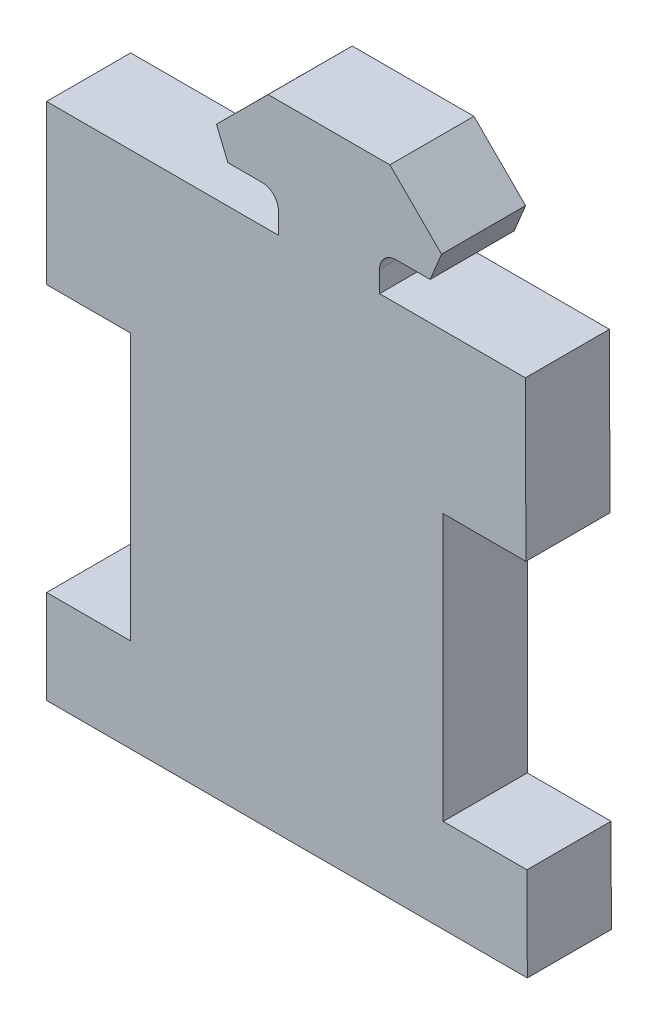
from build123d import *

# Parameters (mm, degrees)
BOSS_EXTRUDE1_DEPTH = 5.3848
SKETCH2_W           = 14.8463
SKETCH2_H           = 0.504650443
SKETCH2_W_2         = 5.3848
SKETCH2_H_2         = 17.0735625
CUT_EXTRUDE1_DEPTH  = 5.3848


with BuildPart() as part:
    # Sketch1 → Boss-Extrude1 (new body)
    with BuildSketch(Plane.XY):
        with BuildLine():
            Line((-444.721163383, -726.20028811), (-446.910439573, -726.20028811))
            Line((-446.910439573, -726.20028811), (-447.640686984, -724.434458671))
            Line((-447.640686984, -724.434458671), (-444.331923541, -721.133257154))
            Line((-444.331923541, -721.133257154), (-436.53537841, -721.133257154))
            Line((-436.53537841, -721.133257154), (-433.226614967, -724.434458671))
            Line((-433.226614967, -724.434458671), (-433.956862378, -726.20028811))
            Line((-433.956862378, -726.20028811), (-436.146138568, -726.20028811))
            ThreePointArc((-436.146138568, -726.20028811), (-436.887902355, -726.50753673), (-437.195150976, -727.249300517))
            Line((-437.195150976, -727.249300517), (-437.195150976, -728.41008811))
            Line((-437.195150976, -728.41008811), (-427.860694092, -728.409991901))
            Line((-427.860694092, -728.409991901), (-427.733650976, -761.832335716))
            Line((-427.733650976, -761.832335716), (-458.518450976, -761.832335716))
            Line((-458.518450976, -761.832335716), (-458.518450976, -728.410011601))
            Line((-458.518450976, -728.410011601), (-443.672150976, -728.41008811))
            Line((-443.672150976, -728.41008811), (-443.672150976, -727.249300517))
            ThreePointArc((-443.672150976, -727.249300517), (-443.979399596, -726.50753673), (-444.721163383, -726.20028811))
        make_face()
    extrude(amount=BOSS_EXTRUDE1_DEPTH)

    # Sketch2 → Cut-Extrude1 (cut)
    with BuildSketch(Plane(origin=(0, 0, 0), x_dir=(-1, 0, 0), z_dir=(0, 0, -1))):
        Polygon((437.195150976, -728.162679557), (427.860694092, -728.10052561), (427.613407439, -728.10052561), (427.613407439, -728.608372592), (427.860694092, -728.608372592), (437.195150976, -728.60852561), align=None)
        with Locations((451.095300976, -728.356200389)):
            Rectangle(SKETCH2_W, SKETCH2_H)
        with Locations((430.426050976, -747.30530686)):
            Rectangle(SKETCH2_W_2, SKETCH2_H_2)
        with Locations((455.826050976, -747.30530686)):
            Rectangle(SKETCH2_W_2, SKETCH2_H_2)
    extrude(amount=-CUT_EXTRUDE1_DEPTH, mode=Mode.SUBTRACT)


solid = part.part
